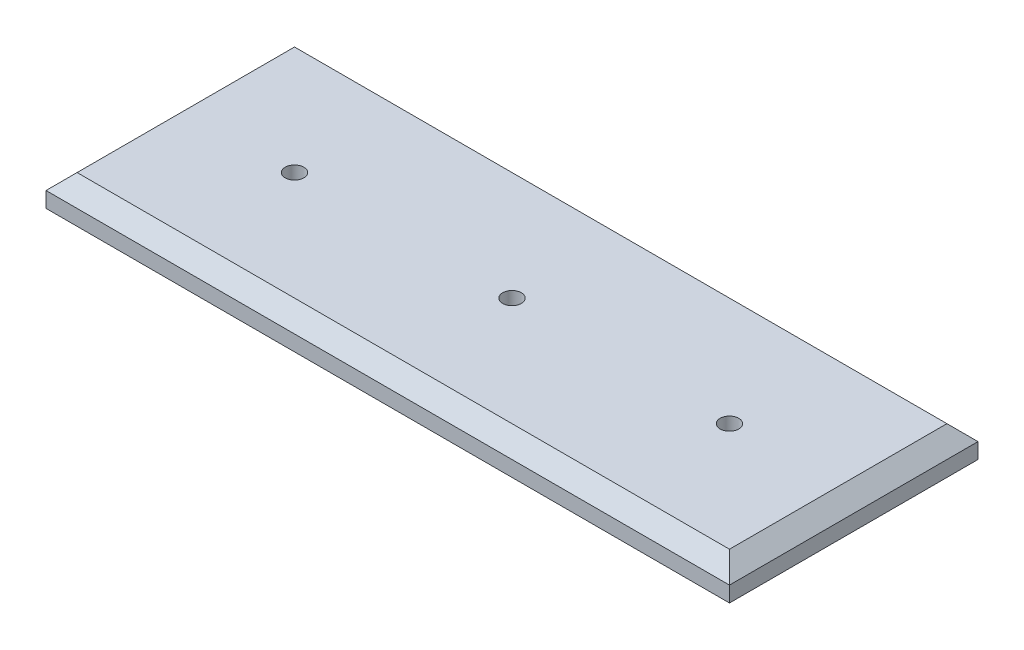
ISO-10303-21;
HEADER;
FILE_DESCRIPTION(('STEP AP214'),'2;1');
FILE_NAME('part.step','',(''),(''),'','','');
FILE_SCHEMA(('AUTOMOTIVE_DESIGN { 1 0 10303 214 1 1 1 1 }'));
ENDSEC;
DATA;
#1=APPLICATION_CONTEXT('core data for automotive mechanical design processes');
#2=APPLICATION_PROTOCOL_DEFINITION('international standard','automotive_design',2000,#1);
#3=PRODUCT_CONTEXT('',#1,'mechanical');
#4=PRODUCT('Part','Part','',(#3));
#5=PRODUCT_RELATED_PRODUCT_CATEGORY('part','',(#4));
#6=PRODUCT_DEFINITION_FORMATION('','',#4);
#7=PRODUCT_DEFINITION_CONTEXT('part definition',#1,'design');
#8=PRODUCT_DEFINITION('design','',#6,#7);
#9=PRODUCT_DEFINITION_SHAPE('','',#8);
#10=(LENGTH_UNIT() NAMED_UNIT(*) SI_UNIT(.MILLI.,.METRE.));
#11=(NAMED_UNIT(*) PLANE_ANGLE_UNIT() SI_UNIT($,.RADIAN.));
#12=(NAMED_UNIT(*) SI_UNIT($,.STERADIAN.) SOLID_ANGLE_UNIT());
#13=UNCERTAINTY_MEASURE_WITH_UNIT(LENGTH_MEASURE(1.E-05),#10,'distance_accuracy_value','');
#14=(GEOMETRIC_REPRESENTATION_CONTEXT(3) GLOBAL_UNCERTAINTY_ASSIGNED_CONTEXT((#13)) GLOBAL_UNIT_ASSIGNED_CONTEXT((#10,
#11,#12)) REPRESENTATION_CONTEXT('',''));
#15=CARTESIAN_POINT('',(0.,0.,0.));
#16=DIRECTION('',(0.,0.,1.));
#17=DIRECTION('',(1.,0.,0.));
#18=AXIS2_PLACEMENT_3D('',#15,#16,#17);
#19=CARTESIAN_POINT('',(0.,10.,0.));
#20=DIRECTION('',(1.,0.,0.));
#21=DIRECTION('',(0.,0.,-1.));
#22=AXIS2_PLACEMENT_3D('',#19,#20,#21);
#23=PLANE('',#22);
#24=DIRECTION('',(0.,-1.,0.));
#25=VECTOR('',#24,1.);
#26=CARTESIAN_POINT('',(0.,10.,0.));
#27=LINE('',#26,#25);
#28=CARTESIAN_POINT('',(0.,4.99999999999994,0.));
#29=VERTEX_POINT('',#28);
#30=CARTESIAN_POINT('',(0.,0.,0.));
#31=VERTEX_POINT('',#30);
#32=EDGE_CURVE('E173',#29,#31,#27,.T.);
#33=ORIENTED_EDGE('',*,*,#32,.F.);
#34=DIRECTION('',(0.,0.,-1.));
#35=VECTOR('',#34,1.);
#36=CARTESIAN_POINT('',(0.,4.99999999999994,0.));
#37=LINE('',#36,#35);
#38=CARTESIAN_POINT('',(0.,4.99999999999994,-80.));
#39=VERTEX_POINT('',#38);
#40=EDGE_CURVE('E184',#29,#39,#37,.T.);
#41=ORIENTED_EDGE('',*,*,#40,.T.);
#42=DIRECTION('',(0.,-1.,0.));
#43=VECTOR('',#42,1.);
#44=CARTESIAN_POINT('',(0.,10.,-80.));
#45=LINE('',#44,#43);
#46=CARTESIAN_POINT('',(0.,0.,-80.));
#47=VERTEX_POINT('',#46);
#48=EDGE_CURVE('E167',#39,#47,#45,.T.);
#49=ORIENTED_EDGE('',*,*,#48,.T.);
#50=DIRECTION('',(0.,0.,1.));
#51=VECTOR('',#50,1.);
#52=CARTESIAN_POINT('',(0.,0.,0.));
#53=LINE('',#52,#51);
#54=EDGE_CURVE('E152',#47,#31,#53,.T.);
#55=ORIENTED_EDGE('',*,*,#54,.T.);
#56=EDGE_LOOP('',(#33,#41,#49,#55));
#57=FACE_BOUND('',#56,.T.);
#58=ADVANCED_FACE('F31',(#57),#23,.F.);
#59=CARTESIAN_POINT('',(0.,10.,0.));
#60=DIRECTION('',(0.,0.,-1.));
#61=DIRECTION('',(-1.,0.,0.));
#62=AXIS2_PLACEMENT_3D('',#59,#60,#61);
#63=PLANE('',#62);
#64=DIRECTION('',(0.,-1.,0.));
#65=VECTOR('',#64,1.);
#66=CARTESIAN_POINT('',(220.,10.,0.));
#67=LINE('',#66,#65);
#68=CARTESIAN_POINT('',(220.,4.99999999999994,0.));
#69=VERTEX_POINT('',#68);
#70=CARTESIAN_POINT('',(220.,0.,0.));
#71=VERTEX_POINT('',#70);
#72=EDGE_CURVE('E171',#69,#71,#67,.T.);
#73=ORIENTED_EDGE('',*,*,#72,.F.);
#74=DIRECTION('',(-1.,0.,0.));
#75=VECTOR('',#74,1.);
#76=CARTESIAN_POINT('',(0.,4.99999999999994,0.));
#77=LINE('',#76,#75);
#78=EDGE_CURVE('E11',#69,#29,#77,.T.);
#79=ORIENTED_EDGE('',*,*,#78,.T.);
#80=ORIENTED_EDGE('',*,*,#32,.T.);
#81=DIRECTION('',(1.,0.,0.));
#82=VECTOR('',#81,1.);
#83=CARTESIAN_POINT('',(0.,0.,0.));
#84=LINE('',#83,#82);
#85=EDGE_CURVE('E158',#31,#71,#84,.T.);
#86=ORIENTED_EDGE('',*,*,#85,.T.);
#87=EDGE_LOOP('',(#73,#79,#80,#86));
#88=FACE_BOUND('',#87,.T.);
#89=ADVANCED_FACE('F242',(#88),#63,.F.);
#90=CARTESIAN_POINT('',(220.,10.,0.));
#91=DIRECTION('',(-1.,0.,0.));
#92=DIRECTION('',(0.,0.,1.));
#93=AXIS2_PLACEMENT_3D('',#90,#91,#92);
#94=PLANE('',#93);
#95=DIRECTION('',(0.,-1.,0.));
#96=VECTOR('',#95,1.);
#97=CARTESIAN_POINT('',(220.,10.,-80.));
#98=LINE('',#97,#96);
#99=CARTESIAN_POINT('',(220.,4.99999999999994,-80.));
#100=VERTEX_POINT('',#99);
#101=CARTESIAN_POINT('',(220.,0.,-80.));
#102=VERTEX_POINT('',#101);
#103=EDGE_CURVE('E169',#100,#102,#98,.T.);
#104=ORIENTED_EDGE('',*,*,#103,.F.);
#105=DIRECTION('',(0.,0.,1.));
#106=VECTOR('',#105,1.);
#107=CARTESIAN_POINT('',(220.,4.99999999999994,0.));
#108=LINE('',#107,#106);
#109=EDGE_CURVE('E40',#100,#69,#108,.T.);
#110=ORIENTED_EDGE('',*,*,#109,.T.);
#111=ORIENTED_EDGE('',*,*,#72,.T.);
#112=DIRECTION('',(0.,0.,-1.));
#113=VECTOR('',#112,1.);
#114=CARTESIAN_POINT('',(220.,0.,0.));
#115=LINE('',#114,#113);
#116=EDGE_CURVE('E161',#71,#102,#115,.T.);
#117=ORIENTED_EDGE('',*,*,#116,.T.);
#118=EDGE_LOOP('',(#104,#110,#111,#117));
#119=FACE_BOUND('',#118,.T.);
#120=ADVANCED_FACE('F237',(#119),#94,.F.);
#121=CARTESIAN_POINT('',(0.,10.,-80.));
#122=DIRECTION('',(0.,0.,1.));
#123=DIRECTION('',(1.,0.,0.));
#124=AXIS2_PLACEMENT_3D('',#121,#122,#123);
#125=PLANE('',#124);
#126=ORIENTED_EDGE('',*,*,#48,.F.);
#127=DIRECTION('',(1.,0.,0.));
#128=VECTOR('',#127,1.);
#129=CARTESIAN_POINT('',(0.,4.99999999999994,-80.));
#130=LINE('',#129,#128);
#131=EDGE_CURVE('E55',#39,#100,#130,.T.);
#132=ORIENTED_EDGE('',*,*,#131,.T.);
#133=ORIENTED_EDGE('',*,*,#103,.T.);
#134=DIRECTION('',(-1.,0.,0.));
#135=VECTOR('',#134,1.);
#136=CARTESIAN_POINT('',(0.,0.,-80.));
#137=LINE('',#136,#135);
#138=EDGE_CURVE('E164',#102,#47,#137,.T.);
#139=ORIENTED_EDGE('',*,*,#138,.T.);
#140=EDGE_LOOP('',(#126,#132,#133,#139));
#141=FACE_BOUND('',#140,.T.);
#142=ADVANCED_FACE('F227',(#141),#125,.F.);
#143=CARTESIAN_POINT('',(0.,10.,-80.));
#144=DIRECTION('',(0.,-1.,0.));
#145=DIRECTION('',(0.,0.,-1.));
#146=AXIS2_PLACEMENT_3D('',#143,#144,#145);
#147=PLANE('',#146);
#148=DIRECTION('',(-1.,0.,0.));
#149=VECTOR('',#148,1.);
#150=CARTESIAN_POINT('',(0.,10.,-75.));
#151=LINE('',#150,#149);
#152=CARTESIAN_POINT('',(215.,10.,-75.));
#153=VERTEX_POINT('',#152);
#154=CARTESIAN_POINT('',(5.00000000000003,10.,-75.));
#155=VERTEX_POINT('',#154);
#156=EDGE_CURVE('E179',#153,#155,#151,.T.);
#157=ORIENTED_EDGE('',*,*,#156,.T.);
#158=DIRECTION('',(0.,0.,1.));
#159=VECTOR('',#158,1.);
#160=CARTESIAN_POINT('',(5.00000000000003,10.,-80.));
#161=LINE('',#160,#159);
#162=CARTESIAN_POINT('',(5.00000000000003,10.,-5.00000000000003));
#163=VERTEX_POINT('',#162);
#164=EDGE_CURVE('E181',#155,#163,#161,.T.);
#165=ORIENTED_EDGE('',*,*,#164,.T.);
#166=DIRECTION('',(1.,0.,0.));
#167=VECTOR('',#166,1.);
#168=CARTESIAN_POINT('',(0.,10.,-5.00000000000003));
#169=LINE('',#168,#167);
#170=CARTESIAN_POINT('',(215.,10.,-5.00000000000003));
#171=VERTEX_POINT('',#170);
#172=EDGE_CURVE('E175',#163,#171,#169,.T.);
#173=ORIENTED_EDGE('',*,*,#172,.T.);
#174=DIRECTION('',(0.,0.,-1.));
#175=VECTOR('',#174,1.);
#176=CARTESIAN_POINT('',(215.,10.,-80.));
#177=LINE('',#176,#175);
#178=EDGE_CURVE('E177',#171,#153,#177,.T.);
#179=ORIENTED_EDGE('',*,*,#178,.T.);
#180=EDGE_LOOP('',(#157,#165,#173,#179));
#181=FACE_BOUND('',#180,.T.);
#182=CARTESIAN_POINT('',(180.,10.,-40.));
#183=DIRECTION('',(0.,1.,0.));
#184=DIRECTION('',(0.,0.,1.));
#185=AXIS2_PLACEMENT_3D('',#182,#183,#184);
#186=CIRCLE('',#185,2.99999999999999);
#187=CARTESIAN_POINT('',(180.,10.,-37.));
#188=VERTEX_POINT('',#187);
#189=EDGE_CURVE('E199',#188,#188,#186,.T.);
#190=ORIENTED_EDGE('',*,*,#189,.F.);
#191=EDGE_LOOP('',(#190));
#192=FACE_BOUND('',#191,.T.);
#193=CARTESIAN_POINT('',(40.,10.,-40.));
#194=DIRECTION('',(0.,1.,0.));
#195=DIRECTION('',(0.,0.,1.));
#196=AXIS2_PLACEMENT_3D('',#193,#194,#195);
#197=CIRCLE('',#196,3.00000000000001);
#198=CARTESIAN_POINT('',(40.,10.,-37.));
#199=VERTEX_POINT('',#198);
#200=EDGE_CURVE('E209',#199,#199,#197,.T.);
#201=ORIENTED_EDGE('',*,*,#200,.F.);
#202=EDGE_LOOP('',(#201));
#203=FACE_BOUND('',#202,.T.);
#204=CARTESIAN_POINT('',(110.,10.,-40.));
#205=DIRECTION('',(0.,1.,0.));
#206=DIRECTION('',(0.,0.,1.));
#207=AXIS2_PLACEMENT_3D('',#204,#205,#206);
#208=CIRCLE('',#207,3.00000000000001);
#209=CARTESIAN_POINT('',(110.,10.,-37.));
#210=VERTEX_POINT('',#209);
#211=EDGE_CURVE('E139',#210,#210,#208,.T.);
#212=ORIENTED_EDGE('',*,*,#211,.F.);
#213=EDGE_LOOP('',(#212));
#214=FACE_BOUND('',#213,.T.);
#215=ADVANCED_FACE('F224',(#181,#192,#203,#214),#147,.F.);
#216=CARTESIAN_POINT('',(0.,0.,-80.));
#217=DIRECTION('',(0.,-1.,0.));
#218=DIRECTION('',(0.,0.,-1.));
#219=AXIS2_PLACEMENT_3D('',#216,#217,#218);
#220=PLANE('',#219);
#221=DIRECTION('',(0.,0.,-1.));
#222=VECTOR('',#221,1.);
#223=CARTESIAN_POINT('',(5.,0.,-5.));
#224=LINE('',#223,#222);
#225=CARTESIAN_POINT('',(5.,0.,-5.));
#226=VERTEX_POINT('',#225);
#227=CARTESIAN_POINT('',(5.00000000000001,0.,-75.));
#228=VERTEX_POINT('',#227);
#229=EDGE_CURVE('E116',#226,#228,#224,.T.);
#230=ORIENTED_EDGE('',*,*,#229,.F.);
#231=DIRECTION('',(-1.,0.,0.));
#232=VECTOR('',#231,1.);
#233=CARTESIAN_POINT('',(5.,0.,-5.));
#234=LINE('',#233,#232);
#235=CARTESIAN_POINT('',(215.,0.,-5.));
#236=VERTEX_POINT('',#235);
#237=EDGE_CURVE('E133',#236,#226,#234,.T.);
#238=ORIENTED_EDGE('',*,*,#237,.F.);
#239=DIRECTION('',(0.,0.,1.));
#240=VECTOR('',#239,1.);
#241=CARTESIAN_POINT('',(215.,0.,-5.));
#242=LINE('',#241,#240);
#243=CARTESIAN_POINT('',(215.,0.,-75.));
#244=VERTEX_POINT('',#243);
#245=EDGE_CURVE('E136',#244,#236,#242,.T.);
#246=ORIENTED_EDGE('',*,*,#245,.F.);
#247=DIRECTION('',(1.,0.,0.));
#248=VECTOR('',#247,1.);
#249=CARTESIAN_POINT('',(5.00000000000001,0.,-75.));
#250=LINE('',#249,#248);
#251=EDGE_CURVE('E145',#228,#244,#250,.T.);
#252=ORIENTED_EDGE('',*,*,#251,.F.);
#253=EDGE_LOOP('',(#230,#238,#246,#252));
#254=FACE_BOUND('',#253,.T.);
#255=ORIENTED_EDGE('',*,*,#54,.F.);
#256=ORIENTED_EDGE('',*,*,#138,.F.);
#257=ORIENTED_EDGE('',*,*,#116,.F.);
#258=ORIENTED_EDGE('',*,*,#85,.F.);
#259=EDGE_LOOP('',(#255,#256,#257,#258));
#260=FACE_BOUND('',#259,.T.);
#261=ADVANCED_FACE('F226',(#254,#260),#220,.T.);
#262=CARTESIAN_POINT('',(5.,5.,-5.));
#263=DIRECTION('',(-1.,0.,0.));
#264=DIRECTION('',(0.,0.,1.));
#265=AXIS2_PLACEMENT_3D('',#262,#263,#264);
#266=PLANE('',#265);
#267=ORIENTED_EDGE('',*,*,#229,.T.);
#268=DIRECTION('',(0.,-1.,0.));
#269=VECTOR('',#268,1.);
#270=CARTESIAN_POINT('',(5.00000000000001,5.,-75.));
#271=LINE('',#270,#269);
#272=CARTESIAN_POINT('',(5.00000000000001,5.,-75.));
#273=VERTEX_POINT('',#272);
#274=EDGE_CURVE('E109',#273,#228,#271,.T.);
#275=ORIENTED_EDGE('',*,*,#274,.F.);
#276=DIRECTION('',(0.,0.,-1.));
#277=VECTOR('',#276,1.);
#278=CARTESIAN_POINT('',(5.,5.,-5.));
#279=LINE('',#278,#277);
#280=CARTESIAN_POINT('',(5.,5.,-5.));
#281=VERTEX_POINT('',#280);
#282=EDGE_CURVE('E113',#281,#273,#279,.T.);
#283=ORIENTED_EDGE('',*,*,#282,.F.);
#284=DIRECTION('',(0.,-1.,0.));
#285=VECTOR('',#284,1.);
#286=CARTESIAN_POINT('',(5.,5.,-5.));
#287=LINE('',#286,#285);
#288=EDGE_CURVE('E150',#281,#226,#287,.T.);
#289=ORIENTED_EDGE('',*,*,#288,.T.);
#290=EDGE_LOOP('',(#267,#275,#283,#289));
#291=FACE_BOUND('',#290,.T.);
#292=ADVANCED_FACE('F111',(#291),#266,.F.);
#293=CARTESIAN_POINT('',(5.,5.,-5.));
#294=DIRECTION('',(0.,0.,1.));
#295=DIRECTION('',(1.,0.,0.));
#296=AXIS2_PLACEMENT_3D('',#293,#294,#295);
#297=PLANE('',#296);
#298=ORIENTED_EDGE('',*,*,#237,.T.);
#299=ORIENTED_EDGE('',*,*,#288,.F.);
#300=DIRECTION('',(-1.,0.,0.));
#301=VECTOR('',#300,1.);
#302=CARTESIAN_POINT('',(5.,5.,-5.));
#303=LINE('',#302,#301);
#304=CARTESIAN_POINT('',(215.,5.,-5.));
#305=VERTEX_POINT('',#304);
#306=EDGE_CURVE('E121',#305,#281,#303,.T.);
#307=ORIENTED_EDGE('',*,*,#306,.F.);
#308=DIRECTION('',(0.,-1.,0.));
#309=VECTOR('',#308,1.);
#310=CARTESIAN_POINT('',(215.,5.,-5.));
#311=LINE('',#310,#309);
#312=EDGE_CURVE('E153',#305,#236,#311,.T.);
#313=ORIENTED_EDGE('',*,*,#312,.T.);
#314=EDGE_LOOP('',(#298,#299,#307,#313));
#315=FACE_BOUND('',#314,.T.);
#316=ADVANCED_FACE('F307',(#315),#297,.F.);
#317=CARTESIAN_POINT('',(215.,5.,-5.));
#318=DIRECTION('',(1.,0.,0.));
#319=DIRECTION('',(0.,0.,-1.));
#320=AXIS2_PLACEMENT_3D('',#317,#318,#319);
#321=PLANE('',#320);
#322=ORIENTED_EDGE('',*,*,#245,.T.);
#323=ORIENTED_EDGE('',*,*,#312,.F.);
#324=DIRECTION('',(0.,0.,1.));
#325=VECTOR('',#324,1.);
#326=CARTESIAN_POINT('',(215.,5.,-5.));
#327=LINE('',#326,#325);
#328=CARTESIAN_POINT('',(215.,5.,-75.));
#329=VERTEX_POINT('',#328);
#330=EDGE_CURVE('E129',#329,#305,#327,.T.);
#331=ORIENTED_EDGE('',*,*,#330,.F.);
#332=DIRECTION('',(0.,-1.,0.));
#333=VECTOR('',#332,1.);
#334=CARTESIAN_POINT('',(215.,5.,-75.));
#335=LINE('',#334,#333);
#336=EDGE_CURVE('E120',#329,#244,#335,.T.);
#337=ORIENTED_EDGE('',*,*,#336,.T.);
#338=EDGE_LOOP('',(#322,#323,#331,#337));
#339=FACE_BOUND('',#338,.T.);
#340=ADVANCED_FACE('F313',(#339),#321,.F.);
#341=CARTESIAN_POINT('',(5.00000000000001,5.,-75.));
#342=DIRECTION('',(0.,0.,-1.));
#343=DIRECTION('',(-1.,0.,0.));
#344=AXIS2_PLACEMENT_3D('',#341,#342,#343);
#345=PLANE('',#344);
#346=ORIENTED_EDGE('',*,*,#251,.T.);
#347=ORIENTED_EDGE('',*,*,#336,.F.);
#348=DIRECTION('',(1.,0.,0.));
#349=VECTOR('',#348,1.);
#350=CARTESIAN_POINT('',(5.00000000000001,5.,-75.));
#351=LINE('',#350,#349);
#352=EDGE_CURVE('E124',#273,#329,#351,.T.);
#353=ORIENTED_EDGE('',*,*,#352,.F.);
#354=ORIENTED_EDGE('',*,*,#274,.T.);
#355=EDGE_LOOP('',(#346,#347,#353,#354));
#356=FACE_BOUND('',#355,.T.);
#357=ADVANCED_FACE('F125',(#356),#345,.F.);
#358=CARTESIAN_POINT('',(5.00000000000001,5.,-75.));
#359=DIRECTION('',(0.,-1.,0.));
#360=DIRECTION('',(0.,0.,-1.));
#361=AXIS2_PLACEMENT_3D('',#358,#359,#360);
#362=PLANE('',#361);
#363=CARTESIAN_POINT('',(180.,5.,-40.));
#364=DIRECTION('',(0.,1.,0.));
#365=DIRECTION('',(0.,0.,1.));
#366=AXIS2_PLACEMENT_3D('',#363,#364,#365);
#367=CIRCLE('',#366,2.99999999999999);
#368=CARTESIAN_POINT('',(180.,5.,-37.));
#369=VERTEX_POINT('',#368);
#370=EDGE_CURVE('E204',#369,#369,#367,.T.);
#371=ORIENTED_EDGE('',*,*,#370,.T.);
#372=EDGE_LOOP('',(#371));
#373=FACE_BOUND('',#372,.T.);
#374=CARTESIAN_POINT('',(40.,5.,-40.));
#375=DIRECTION('',(0.,1.,0.));
#376=DIRECTION('',(0.,0.,1.));
#377=AXIS2_PLACEMENT_3D('',#374,#375,#376);
#378=CIRCLE('',#377,3.00000000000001);
#379=CARTESIAN_POINT('',(40.,5.,-37.));
#380=VERTEX_POINT('',#379);
#381=EDGE_CURVE('E212',#380,#380,#378,.T.);
#382=ORIENTED_EDGE('',*,*,#381,.T.);
#383=EDGE_LOOP('',(#382));
#384=FACE_BOUND('',#383,.T.);
#385=CARTESIAN_POINT('',(110.,5.,-40.));
#386=DIRECTION('',(0.,1.,0.));
#387=DIRECTION('',(0.,0.,1.));
#388=AXIS2_PLACEMENT_3D('',#385,#386,#387);
#389=CIRCLE('',#388,3.00000000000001);
#390=CARTESIAN_POINT('',(110.,5.,-37.));
#391=VERTEX_POINT('',#390);
#392=EDGE_CURVE('E146',#391,#391,#389,.T.);
#393=ORIENTED_EDGE('',*,*,#392,.T.);
#394=EDGE_LOOP('',(#393));
#395=FACE_BOUND('',#394,.T.);
#396=ORIENTED_EDGE('',*,*,#282,.T.);
#397=ORIENTED_EDGE('',*,*,#352,.T.);
#398=ORIENTED_EDGE('',*,*,#330,.T.);
#399=ORIENTED_EDGE('',*,*,#306,.T.);
#400=EDGE_LOOP('',(#396,#397,#398,#399));
#401=FACE_BOUND('',#400,.T.);
#402=ADVANCED_FACE('F131',(#373,#384,#395,#401),#362,.T.);
#403=CARTESIAN_POINT('',(110.,5.,-40.));
#404=DIRECTION('',(0.,1.,0.));
#405=DIRECTION('',(0.,0.,1.));
#406=AXIS2_PLACEMENT_3D('',#403,#404,#405);
#407=CYLINDRICAL_SURFACE('',#406,3.00000000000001);
#408=ORIENTED_EDGE('',*,*,#392,.F.);
#409=EDGE_LOOP('',(#408));
#410=FACE_BOUND('',#409,.T.);
#411=ORIENTED_EDGE('',*,*,#211,.T.);
#412=EDGE_LOOP('',(#411));
#413=FACE_BOUND('',#412,.T.);
#414=ADVANCED_FACE('F222',(#410,#413),#407,.F.);
#415=CARTESIAN_POINT('',(40.,5.,-40.));
#416=DIRECTION('',(0.,1.,0.));
#417=DIRECTION('',(0.,0.,1.));
#418=AXIS2_PLACEMENT_3D('',#415,#416,#417);
#419=CYLINDRICAL_SURFACE('',#418,3.00000000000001);
#420=ORIENTED_EDGE('',*,*,#381,.F.);
#421=EDGE_LOOP('',(#420));
#422=FACE_BOUND('',#421,.T.);
#423=ORIENTED_EDGE('',*,*,#200,.T.);
#424=EDGE_LOOP('',(#423));
#425=FACE_BOUND('',#424,.T.);
#426=ADVANCED_FACE('F269',(#422,#425),#419,.F.);
#427=CARTESIAN_POINT('',(180.,5.,-40.));
#428=DIRECTION('',(0.,1.,0.));
#429=DIRECTION('',(0.,0.,1.));
#430=AXIS2_PLACEMENT_3D('',#427,#428,#429);
#431=CYLINDRICAL_SURFACE('',#430,2.99999999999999);
#432=ORIENTED_EDGE('',*,*,#370,.F.);
#433=EDGE_LOOP('',(#432));
#434=FACE_BOUND('',#433,.T.);
#435=ORIENTED_EDGE('',*,*,#189,.T.);
#436=EDGE_LOOP('',(#435));
#437=FACE_BOUND('',#436,.T.);
#438=ADVANCED_FACE('F265',(#434,#437),#431,.F.);
#439=CARTESIAN_POINT('',(215.,10.,-80.));
#440=DIRECTION('',(-0.707106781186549,-0.707106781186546,0.));
#441=DIRECTION('',(0.707106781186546,-0.707106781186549,0.));
#442=AXIS2_PLACEMENT_3D('',#439,#440,#441);
#443=PLANE('',#442);
#444=DIRECTION('',(-0.577350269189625,0.577350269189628,-0.577350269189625));
#445=VECTOR('',#444,1.);
#446=CARTESIAN_POINT('',(143.333333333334,81.6666666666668,-76.6666666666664));
#447=LINE('',#446,#445);
#448=EDGE_CURVE('E192',#69,#171,#447,.T.);
#449=ORIENTED_EDGE('',*,*,#448,.F.);
#450=ORIENTED_EDGE('',*,*,#109,.F.);
#451=DIRECTION('',(-0.577350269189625,0.577350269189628,0.577350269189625));
#452=VECTOR('',#451,1.);
#453=CARTESIAN_POINT('',(216.666666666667,8.33333333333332,-76.6666666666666));
#454=LINE('',#453,#452);
#455=EDGE_CURVE('E35',#153,#100,#454,.F.);
#456=ORIENTED_EDGE('',*,*,#455,.F.);
#457=ORIENTED_EDGE('',*,*,#178,.F.);
#458=EDGE_LOOP('',(#449,#450,#456,#457));
#459=FACE_BOUND('',#458,.T.);
#460=ADVANCED_FACE('F33',(#459),#443,.F.);
#461=CARTESIAN_POINT('',(0.,10.,-75.));
#462=DIRECTION('',(0.,-0.707106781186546,0.707106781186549));
#463=DIRECTION('',(0.,-0.707106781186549,-0.707106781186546));
#464=AXIS2_PLACEMENT_3D('',#461,#462,#463);
#465=PLANE('',#464);
#466=ORIENTED_EDGE('',*,*,#455,.T.);
#467=ORIENTED_EDGE('',*,*,#131,.F.);
#468=DIRECTION('',(0.577350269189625,0.577350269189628,0.577350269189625));
#469=VECTOR('',#468,1.);
#470=CARTESIAN_POINT('',(3.33333333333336,8.33333333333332,-76.6666666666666));
#471=LINE('',#470,#469);
#472=EDGE_CURVE('E191',#155,#39,#471,.F.);
#473=ORIENTED_EDGE('',*,*,#472,.F.);
#474=ORIENTED_EDGE('',*,*,#156,.F.);
#475=EDGE_LOOP('',(#466,#467,#473,#474));
#476=FACE_BOUND('',#475,.T.);
#477=ADVANCED_FACE('F260',(#476),#465,.F.);
#478=CARTESIAN_POINT('',(0.,10.,-5.00000000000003));
#479=DIRECTION('',(0.,-0.707106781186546,-0.707106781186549));
#480=DIRECTION('',(0.,0.707106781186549,-0.707106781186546));
#481=AXIS2_PLACEMENT_3D('',#478,#479,#480);
#482=PLANE('',#481);
#483=ORIENTED_EDGE('',*,*,#448,.T.);
#484=ORIENTED_EDGE('',*,*,#172,.F.);
#485=DIRECTION('',(-0.577350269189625,-0.577350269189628,0.577350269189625));
#486=VECTOR('',#485,1.);
#487=CARTESIAN_POINT('',(3.33333333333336,8.33333333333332,-3.33333333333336));
#488=LINE('',#487,#486);
#489=EDGE_CURVE('E189',#29,#163,#488,.F.);
#490=ORIENTED_EDGE('',*,*,#489,.F.);
#491=ORIENTED_EDGE('',*,*,#78,.F.);
#492=EDGE_LOOP('',(#483,#484,#490,#491));
#493=FACE_BOUND('',#492,.T.);
#494=ADVANCED_FACE('F257',(#493),#482,.F.);
#495=CARTESIAN_POINT('',(5.00000000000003,10.,-80.));
#496=DIRECTION('',(0.707106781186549,-0.707106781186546,0.));
#497=DIRECTION('',(0.707106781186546,0.707106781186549,0.));
#498=AXIS2_PLACEMENT_3D('',#495,#496,#497);
#499=PLANE('',#498);
#500=ORIENTED_EDGE('',*,*,#472,.T.);
#501=ORIENTED_EDGE('',*,*,#40,.F.);
#502=ORIENTED_EDGE('',*,*,#489,.T.);
#503=ORIENTED_EDGE('',*,*,#164,.F.);
#504=EDGE_LOOP('',(#500,#501,#502,#503));
#505=FACE_BOUND('',#504,.T.);
#506=ADVANCED_FACE('F254',(#505),#499,.F.);
#507=CLOSED_SHELL('',(#58,#89,#120,#142,#215,#261,#292,#316,#340,#357,#402,#414,#426,#438,#460,
#477,#494,#506));
#508=MANIFOLD_SOLID_BREP('B2',#507);
#509=ADVANCED_BREP_SHAPE_REPRESENTATION('',(#18,#508),#14);
#510=SHAPE_DEFINITION_REPRESENTATION(#9,#509);
ENDSEC;
END-ISO-10303-21;
